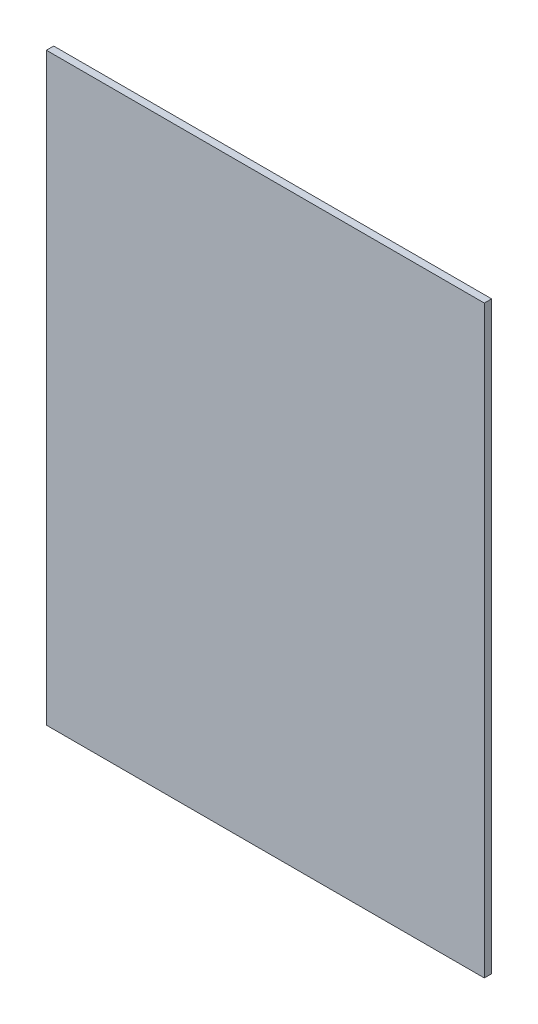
ISO-10303-21;
HEADER;
FILE_DESCRIPTION(('STEP AP214'),'2;1');
FILE_NAME('part.step','',(''),(''),'','','');
FILE_SCHEMA(('AUTOMOTIVE_DESIGN { 1 0 10303 214 1 1 1 1 }'));
ENDSEC;
DATA;
#1=APPLICATION_CONTEXT('core data for automotive mechanical design processes');
#2=APPLICATION_PROTOCOL_DEFINITION('international standard','automotive_design',2000,#1);
#3=PRODUCT_CONTEXT('',#1,'mechanical');
#4=PRODUCT('Part','Part','',(#3));
#5=PRODUCT_RELATED_PRODUCT_CATEGORY('part','',(#4));
#6=PRODUCT_DEFINITION_FORMATION('','',#4);
#7=PRODUCT_DEFINITION_CONTEXT('part definition',#1,'design');
#8=PRODUCT_DEFINITION('design','',#6,#7);
#9=PRODUCT_DEFINITION_SHAPE('','',#8);
#10=(LENGTH_UNIT() NAMED_UNIT(*) SI_UNIT(.MILLI.,.METRE.));
#11=(NAMED_UNIT(*) PLANE_ANGLE_UNIT() SI_UNIT($,.RADIAN.));
#12=(NAMED_UNIT(*) SI_UNIT($,.STERADIAN.) SOLID_ANGLE_UNIT());
#13=UNCERTAINTY_MEASURE_WITH_UNIT(LENGTH_MEASURE(1.E-05),#10,'distance_accuracy_value','');
#14=(GEOMETRIC_REPRESENTATION_CONTEXT(3) GLOBAL_UNCERTAINTY_ASSIGNED_CONTEXT((#13)) GLOBAL_UNIT_ASSIGNED_CONTEXT((#10,
#11,#12)) REPRESENTATION_CONTEXT('',''));
#15=CARTESIAN_POINT('',(0.,0.,0.));
#16=DIRECTION('',(0.,0.,1.));
#17=DIRECTION('',(1.,0.,0.));
#18=AXIS2_PLACEMENT_3D('',#15,#16,#17);
#19=CARTESIAN_POINT('',(-0.29972,0.40004746,0.));
#20=DIRECTION('',(-4.2372702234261E-06,0.999999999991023,0.));
#21=DIRECTION('',(0.999999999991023,4.2372702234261E-06,0.));
#22=AXIS2_PLACEMENT_3D('',#19,#20,#21);
#23=PLANE('',#22);
#24=DIRECTION('',(0.,0.,1.));
#25=VECTOR('',#24,1.);
#26=CARTESIAN_POINT('',(-0.29972,0.40004746,0.));
#27=LINE('',#26,#25);
#28=CARTESIAN_POINT('',(-0.29972,0.40004746,0.));
#29=VERTEX_POINT('',#28);
#30=CARTESIAN_POINT('',(-0.29972,0.40004746,0.00999998));
#31=VERTEX_POINT('',#30);
#32=EDGE_CURVE('E11',#29,#31,#27,.T.);
#33=ORIENTED_EDGE('',*,*,#32,.T.);
#34=DIRECTION('',(0.999999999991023,4.2372702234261E-06,0.));
#35=VECTOR('',#34,1.);
#36=CARTESIAN_POINT('',(-0.29972,0.40004746,0.00999998));
#37=LINE('',#36,#35);
#38=CARTESIAN_POINT('',(0.29972254,0.40005,0.00999998));
#39=VERTEX_POINT('',#38);
#40=EDGE_CURVE('E25',#31,#39,#37,.T.);
#41=ORIENTED_EDGE('',*,*,#40,.T.);
#42=DIRECTION('',(0.,0.,1.));
#43=VECTOR('',#42,1.);
#44=CARTESIAN_POINT('',(0.29972254,0.40005,0.));
#45=LINE('',#44,#43);
#46=CARTESIAN_POINT('',(0.29972254,0.40005,0.));
#47=VERTEX_POINT('',#46);
#48=EDGE_CURVE('E73',#47,#39,#45,.T.);
#49=ORIENTED_EDGE('',*,*,#48,.F.);
#50=DIRECTION('',(0.999999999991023,4.2372702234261E-06,0.));
#51=VECTOR('',#50,1.);
#52=CARTESIAN_POINT('',(-0.29972,0.40004746,0.));
#53=LINE('',#52,#51);
#54=EDGE_CURVE('E99',#29,#47,#53,.T.);
#55=ORIENTED_EDGE('',*,*,#54,.F.);
#56=EDGE_LOOP('',(#33,#41,#49,#55));
#57=FACE_BOUND('',#56,.T.);
#58=ADVANCED_FACE('F17',(#57),#23,.T.);
#59=CARTESIAN_POINT('',(1.541979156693E-06,-6.349986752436E-07,0.));
#60=DIRECTION('',(0.,0.,-1.));
#61=DIRECTION('',(-1.,0.,0.));
#62=AXIS2_PLACEMENT_3D('',#59,#60,#61);
#63=PLANE('',#62);
#64=ORIENTED_EDGE('',*,*,#54,.T.);
#65=DIRECTION('',(0.,-1.,0.));
#66=VECTOR('',#65,1.);
#67=CARTESIAN_POINT('',(0.29972254,0.40005,0.));
#68=LINE('',#67,#66);
#69=CARTESIAN_POINT('',(0.29972254,-0.40005,0.));
#70=VERTEX_POINT('',#69);
#71=EDGE_CURVE('E95',#47,#70,#68,.T.);
#72=ORIENTED_EDGE('',*,*,#71,.T.);
#73=DIRECTION('',(-1.,0.,0.));
#74=VECTOR('',#73,1.);
#75=CARTESIAN_POINT('',(0.29972254,-0.40005,0.));
#76=LINE('',#75,#74);
#77=CARTESIAN_POINT('',(-0.29972,-0.40005,0.));
#78=VERTEX_POINT('',#77);
#79=EDGE_CURVE('E68',#70,#78,#76,.T.);
#80=ORIENTED_EDGE('',*,*,#79,.T.);
#81=DIRECTION('',(0.,1.,0.));
#82=VECTOR('',#81,1.);
#83=CARTESIAN_POINT('',(-0.29972,-0.40005,0.));
#84=LINE('',#83,#82);
#85=EDGE_CURVE('E87',#78,#29,#84,.T.);
#86=ORIENTED_EDGE('',*,*,#85,.T.);
#87=EDGE_LOOP('',(#64,#72,#80,#86));
#88=FACE_BOUND('',#87,.T.);
#89=ADVANCED_FACE('F112',(#88),#63,.T.);
#90=CARTESIAN_POINT('',(-0.29972,-0.40005,0.));
#91=DIRECTION('',(-1.,0.,0.));
#92=DIRECTION('',(0.,1.,0.));
#93=AXIS2_PLACEMENT_3D('',#90,#91,#92);
#94=PLANE('',#93);
#95=DIRECTION('',(0.,0.,1.));
#96=VECTOR('',#95,1.);
#97=CARTESIAN_POINT('',(-0.29972,-0.40005,0.));
#98=LINE('',#97,#96);
#99=CARTESIAN_POINT('',(-0.29972,-0.40005,0.00999998));
#100=VERTEX_POINT('',#99);
#101=EDGE_CURVE('E83',#78,#100,#98,.T.);
#102=ORIENTED_EDGE('',*,*,#101,.T.);
#103=DIRECTION('',(0.,1.,0.));
#104=VECTOR('',#103,1.);
#105=CARTESIAN_POINT('',(-0.29972,-0.40005,0.00999998));
#106=LINE('',#105,#104);
#107=EDGE_CURVE('E60',#100,#31,#106,.T.);
#108=ORIENTED_EDGE('',*,*,#107,.T.);
#109=ORIENTED_EDGE('',*,*,#32,.F.);
#110=ORIENTED_EDGE('',*,*,#85,.F.);
#111=EDGE_LOOP('',(#102,#108,#109,#110));
#112=FACE_BOUND('',#111,.T.);
#113=ADVANCED_FACE('F119',(#112),#94,.T.);
#114=CARTESIAN_POINT('',(1.541979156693E-06,-6.349986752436E-07,0.00999998));
#115=DIRECTION('',(0.,0.,-1.));
#116=DIRECTION('',(-1.,0.,0.));
#117=AXIS2_PLACEMENT_3D('',#114,#115,#116);
#118=PLANE('',#117);
#119=ORIENTED_EDGE('',*,*,#107,.F.);
#120=DIRECTION('',(-1.,0.,0.));
#121=VECTOR('',#120,1.);
#122=CARTESIAN_POINT('',(0.29972254,-0.40005,0.00999998));
#123=LINE('',#122,#121);
#124=CARTESIAN_POINT('',(0.29972254,-0.40005,0.00999998));
#125=VERTEX_POINT('',#124);
#126=EDGE_CURVE('E54',#125,#100,#123,.T.);
#127=ORIENTED_EDGE('',*,*,#126,.F.);
#128=DIRECTION('',(0.,-1.,0.));
#129=VECTOR('',#128,1.);
#130=CARTESIAN_POINT('',(0.29972254,0.40005,0.00999998));
#131=LINE('',#130,#129);
#132=EDGE_CURVE('E58',#39,#125,#131,.T.);
#133=ORIENTED_EDGE('',*,*,#132,.F.);
#134=ORIENTED_EDGE('',*,*,#40,.F.);
#135=EDGE_LOOP('',(#119,#127,#133,#134));
#136=FACE_BOUND('',#135,.T.);
#137=ADVANCED_FACE('F56',(#136),#118,.F.);
#138=CARTESIAN_POINT('',(0.29972254,0.40005,0.));
#139=DIRECTION('',(1.,0.,0.));
#140=DIRECTION('',(0.,-1.,0.));
#141=AXIS2_PLACEMENT_3D('',#138,#139,#140);
#142=PLANE('',#141);
#143=ORIENTED_EDGE('',*,*,#48,.T.);
#144=ORIENTED_EDGE('',*,*,#132,.T.);
#145=DIRECTION('',(0.,0.,1.));
#146=VECTOR('',#145,1.);
#147=CARTESIAN_POINT('',(0.29972254,-0.40005,0.));
#148=LINE('',#147,#146);
#149=EDGE_CURVE('E66',#70,#125,#148,.T.);
#150=ORIENTED_EDGE('',*,*,#149,.F.);
#151=ORIENTED_EDGE('',*,*,#71,.F.);
#152=EDGE_LOOP('',(#143,#144,#150,#151));
#153=FACE_BOUND('',#152,.T.);
#154=ADVANCED_FACE('F72',(#153),#142,.T.);
#155=CARTESIAN_POINT('',(0.29972254,-0.40005,0.));
#156=DIRECTION('',(0.,-1.,0.));
#157=DIRECTION('',(-1.,0.,0.));
#158=AXIS2_PLACEMENT_3D('',#155,#156,#157);
#159=PLANE('',#158);
#160=ORIENTED_EDGE('',*,*,#149,.T.);
#161=ORIENTED_EDGE('',*,*,#126,.T.);
#162=ORIENTED_EDGE('',*,*,#101,.F.);
#163=ORIENTED_EDGE('',*,*,#79,.F.);
#164=EDGE_LOOP('',(#160,#161,#162,#163));
#165=FACE_BOUND('',#164,.T.);
#166=ADVANCED_FACE('F67',(#165),#159,.T.);
#167=CLOSED_SHELL('',(#58,#89,#113,#137,#154,#166));
#168=MANIFOLD_SOLID_BREP('B1',#167);
#169=ADVANCED_BREP_SHAPE_REPRESENTATION('',(#18,#168),#14);
#170=SHAPE_DEFINITION_REPRESENTATION(#9,#169);
ENDSEC;
END-ISO-10303-21;
